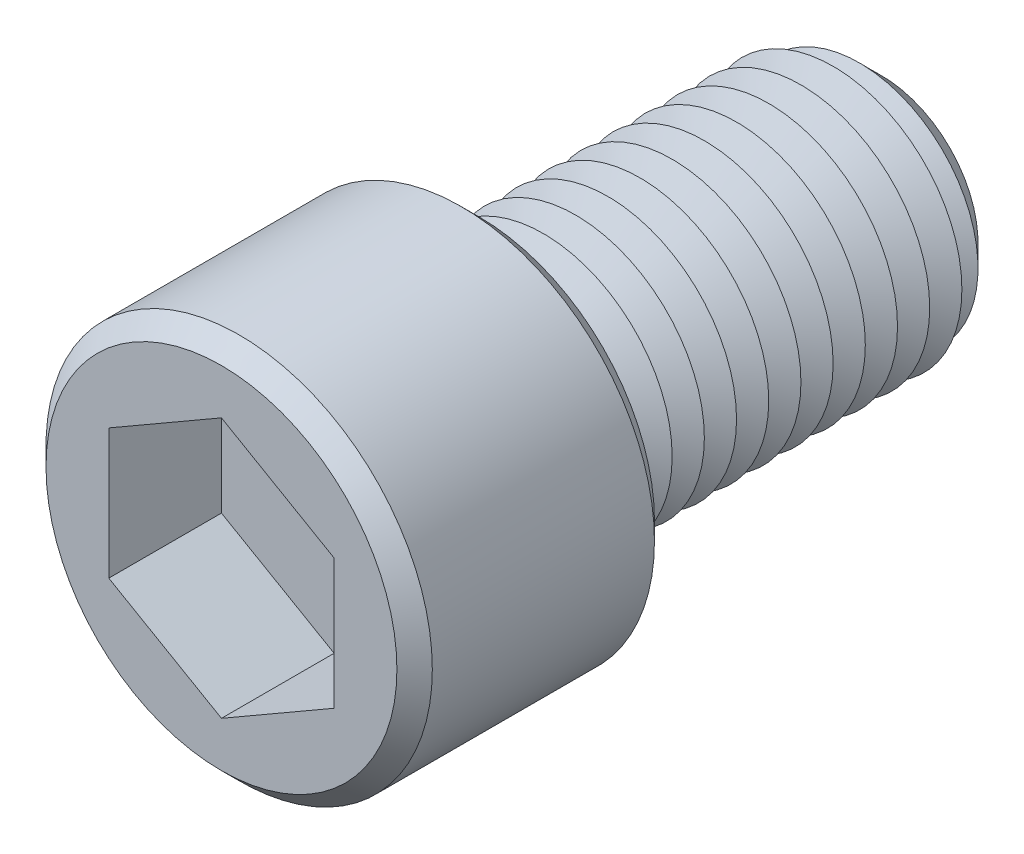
ISO-10303-21;
HEADER;
FILE_DESCRIPTION(('STEP AP214'),'2;1');
FILE_NAME('part.step','',(''),(''),'','','');
FILE_SCHEMA(('AUTOMOTIVE_DESIGN { 1 0 10303 214 1 1 1 1 }'));
ENDSEC;
DATA;
#1=APPLICATION_CONTEXT('core data for automotive mechanical design processes');
#2=APPLICATION_PROTOCOL_DEFINITION('international standard','automotive_design',2000,#1);
#3=PRODUCT_CONTEXT('',#1,'mechanical');
#4=PRODUCT('Part','Part','',(#3));
#5=PRODUCT_RELATED_PRODUCT_CATEGORY('part','',(#4));
#6=PRODUCT_DEFINITION_FORMATION('','',#4);
#7=PRODUCT_DEFINITION_CONTEXT('part definition',#1,'design');
#8=PRODUCT_DEFINITION('design','',#6,#7);
#9=PRODUCT_DEFINITION_SHAPE('','',#8);
#10=(LENGTH_UNIT() NAMED_UNIT(*) SI_UNIT(.MILLI.,.METRE.));
#11=(NAMED_UNIT(*) PLANE_ANGLE_UNIT() SI_UNIT($,.RADIAN.));
#12=(NAMED_UNIT(*) SI_UNIT($,.STERADIAN.) SOLID_ANGLE_UNIT());
#13=UNCERTAINTY_MEASURE_WITH_UNIT(LENGTH_MEASURE(1.E-05),#10,'distance_accuracy_value','');
#14=(GEOMETRIC_REPRESENTATION_CONTEXT(3) GLOBAL_UNCERTAINTY_ASSIGNED_CONTEXT((#13)) GLOBAL_UNIT_ASSIGNED_CONTEXT((#10,
#11,#12)) REPRESENTATION_CONTEXT('',''));
#15=CARTESIAN_POINT('',(0.,0.,0.));
#16=DIRECTION('',(0.,0.,1.));
#17=DIRECTION('',(1.,0.,0.));
#18=AXIS2_PLACEMENT_3D('',#15,#16,#17);
#19=CARTESIAN_POINT('',(0.,0.,16.));
#20=DIRECTION('',(0.,0.,-1.));
#21=DIRECTION('',(-1.,0.,0.));
#22=AXIS2_PLACEMENT_3D('',#19,#20,#21);
#23=CYLINDRICAL_SURFACE('',#22,12.);
#24=CARTESIAN_POINT('',(0.,0.,1.1));
#25=DIRECTION('',(0.,0.,1.));
#26=DIRECTION('',(1.,0.,0.));
#27=AXIS2_PLACEMENT_3D('',#24,#25,#26);
#28=CIRCLE('',#27,12.);
#29=CARTESIAN_POINT('',(12.,0.,1.1));
#30=VERTEX_POINT('',#29);
#31=EDGE_CURVE('E272',#30,#30,#28,.T.);
#32=ORIENTED_EDGE('',*,*,#31,.T.);
#33=EDGE_LOOP('',(#32));
#34=FACE_BOUND('',#33,.T.);
#35=CARTESIAN_POINT('',(0.,0.,14.9));
#36=DIRECTION('',(0.,0.,1.));
#37=DIRECTION('',(1.,0.,0.));
#38=AXIS2_PLACEMENT_3D('',#35,#36,#37);
#39=CIRCLE('',#38,12.);
#40=CARTESIAN_POINT('',(12.,0.,14.9));
#41=VERTEX_POINT('',#40);
#42=EDGE_CURVE('E265',#41,#41,#39,.F.);
#43=ORIENTED_EDGE('',*,*,#42,.T.);
#44=EDGE_LOOP('',(#43));
#45=FACE_BOUND('',#44,.T.);
#46=ADVANCED_FACE('F39',(#34,#45),#23,.T.);
#47=CARTESIAN_POINT('',(0.,0.,16.));
#48=DIRECTION('',(0.,0.,1.));
#49=DIRECTION('',(1.,0.,0.));
#50=AXIS2_PLACEMENT_3D('',#47,#48,#49);
#51=PLANE('',#50);
#52=CARTESIAN_POINT('',(0.,0.,16.));
#53=DIRECTION('',(0.,0.,1.));
#54=DIRECTION('',(1.,0.,0.));
#55=AXIS2_PLACEMENT_3D('',#52,#53,#54);
#56=CIRCLE('',#55,10.9);
#57=CARTESIAN_POINT('',(10.9,0.,16.));
#58=VERTEX_POINT('',#57);
#59=EDGE_CURVE('E11',#58,#58,#56,.T.);
#60=ORIENTED_EDGE('',*,*,#59,.T.);
#61=EDGE_LOOP('',(#60));
#62=FACE_BOUND('',#61,.T.);
#63=DIRECTION('',(-0.866025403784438,0.5,0.));
#64=VECTOR('',#63,1.);
#65=CARTESIAN_POINT('',(7.,4.04145188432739,16.));
#66=LINE('',#65,#64);
#67=CARTESIAN_POINT('',(7.,4.04145188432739,16.));
#68=VERTEX_POINT('',#67);
#69=CARTESIAN_POINT('',(0.,8.08290376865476,16.));
#70=VERTEX_POINT('',#69);
#71=EDGE_CURVE('E55',#68,#70,#66,.T.);
#72=ORIENTED_EDGE('',*,*,#71,.F.);
#73=DIRECTION('',(0.,1.,0.));
#74=VECTOR('',#73,1.);
#75=CARTESIAN_POINT('',(7.,-4.04145188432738,16.));
#76=LINE('',#75,#74);
#77=CARTESIAN_POINT('',(7.,-4.04145188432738,16.));
#78=VERTEX_POINT('',#77);
#79=EDGE_CURVE('E151',#78,#68,#76,.T.);
#80=ORIENTED_EDGE('',*,*,#79,.F.);
#81=DIRECTION('',(0.866025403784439,0.5,0.));
#82=VECTOR('',#81,1.);
#83=CARTESIAN_POINT('',(0.,-8.08290376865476,16.));
#84=LINE('',#83,#82);
#85=CARTESIAN_POINT('',(0.,-8.08290376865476,16.));
#86=VERTEX_POINT('',#85);
#87=EDGE_CURVE('E148',#86,#78,#84,.T.);
#88=ORIENTED_EDGE('',*,*,#87,.F.);
#89=DIRECTION('',(0.866025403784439,-0.5,0.));
#90=VECTOR('',#89,1.);
#91=CARTESIAN_POINT('',(-7.,-4.04145188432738,16.));
#92=LINE('',#91,#90);
#93=CARTESIAN_POINT('',(-7.,-4.04145188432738,16.));
#94=VERTEX_POINT('',#93);
#95=EDGE_CURVE('E103',#94,#86,#92,.T.);
#96=ORIENTED_EDGE('',*,*,#95,.F.);
#97=DIRECTION('',(0.,-1.,0.));
#98=VECTOR('',#97,1.);
#99=CARTESIAN_POINT('',(-7.,4.04145188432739,16.));
#100=LINE('',#99,#98);
#101=CARTESIAN_POINT('',(-7.,4.04145188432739,16.));
#102=VERTEX_POINT('',#101);
#103=EDGE_CURVE('E142',#102,#94,#100,.T.);
#104=ORIENTED_EDGE('',*,*,#103,.F.);
#105=DIRECTION('',(-0.866025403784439,-0.5,0.));
#106=VECTOR('',#105,1.);
#107=CARTESIAN_POINT('',(0.,8.08290376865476,16.));
#108=LINE('',#107,#106);
#109=EDGE_CURVE('E137',#70,#102,#108,.T.);
#110=ORIENTED_EDGE('',*,*,#109,.F.);
#111=EDGE_LOOP('',(#72,#80,#88,#96,#104,#110));
#112=FACE_BOUND('',#111,.T.);
#113=ADVANCED_FACE('F291',(#62,#112),#51,.T.);
#114=CARTESIAN_POINT('',(0.,0.,0.));
#115=DIRECTION('',(0.,0.,1.));
#116=DIRECTION('',(1.,0.,0.));
#117=AXIS2_PLACEMENT_3D('',#114,#115,#116);
#118=PLANE('',#117);
#119=CARTESIAN_POINT('',(0.,0.,0.));
#120=DIRECTION('',(0.,0.,1.));
#121=DIRECTION('',(1.,0.,0.));
#122=AXIS2_PLACEMENT_3D('',#119,#120,#121);
#123=CIRCLE('',#122,10.9);
#124=CARTESIAN_POINT('',(10.9,0.,0.));
#125=VERTEX_POINT('',#124);
#126=EDGE_CURVE('E48',#125,#125,#123,.F.);
#127=ORIENTED_EDGE('',*,*,#126,.T.);
#128=EDGE_LOOP('',(#127));
#129=FACE_BOUND('',#128,.T.);
#130=CARTESIAN_POINT('',(0.,0.,0.));
#131=DIRECTION('',(0.,0.,1.));
#132=DIRECTION('',(1.,0.,0.));
#133=AXIS2_PLACEMENT_3D('',#130,#131,#132);
#134=CIRCLE('',#133,8.);
#135=CARTESIAN_POINT('',(8.,0.,0.));
#136=VERTEX_POINT('',#135);
#137=EDGE_CURVE('E257',#136,#136,#134,.T.);
#138=ORIENTED_EDGE('',*,*,#137,.T.);
#139=EDGE_LOOP('',(#138));
#140=FACE_BOUND('',#139,.T.);
#141=ADVANCED_FACE('F280',(#129,#140),#118,.F.);
#142=CARTESIAN_POINT('',(0.,0.,0.));
#143=DIRECTION('',(0.,0.,1.));
#144=DIRECTION('',(1.,0.,0.));
#145=AXIS2_PLACEMENT_3D('',#142,#143,#144);
#146=CONICAL_SURFACE('',#145,8.,1.0471975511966);
#147=CARTESIAN_POINT('',(0.,0.,-0.999999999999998));
#148=DIRECTION('',(0.,0.,1.));
#149=DIRECTION('',(1.,0.,0.));
#150=AXIS2_PLACEMENT_3D('',#147,#148,#149);
#151=CIRCLE('',#150,6.26794919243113);
#152=CARTESIAN_POINT('',(6.26794919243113,0.,-0.999999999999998));
#153=VERTEX_POINT('',#152);
#154=EDGE_CURVE('E253',#153,#153,#151,.T.);
#155=ORIENTED_EDGE('',*,*,#154,.T.);
#156=EDGE_LOOP('',(#155));
#157=FACE_BOUND('',#156,.T.);
#158=ORIENTED_EDGE('',*,*,#137,.F.);
#159=EDGE_LOOP('',(#158));
#160=FACE_BOUND('',#159,.T.);
#161=ADVANCED_FACE('F436',(#157,#160),#146,.T.);
#162=CARTESIAN_POINT('',(0.,0.,-0.999999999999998));
#163=DIRECTION('',(0.,0.,-1.));
#164=DIRECTION('',(-1.,0.,0.));
#165=AXIS2_PLACEMENT_3D('',#162,#163,#164);
#166=CONICAL_SURFACE('',#165,6.26794919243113,1.0471975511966);
#167=CARTESIAN_POINT('',(0.,0.,-2.));
#168=DIRECTION('',(0.,0.,1.));
#169=DIRECTION('',(1.,0.,0.));
#170=AXIS2_PLACEMENT_3D('',#167,#168,#169);
#171=CIRCLE('',#170,8.);
#172=CARTESIAN_POINT('',(8.,0.,-2.));
#173=VERTEX_POINT('',#172);
#174=EDGE_CURVE('E249',#173,#173,#171,.T.);
#175=ORIENTED_EDGE('',*,*,#174,.T.);
#176=EDGE_LOOP('',(#175));
#177=FACE_BOUND('',#176,.T.);
#178=ORIENTED_EDGE('',*,*,#154,.F.);
#179=EDGE_LOOP('',(#178));
#180=FACE_BOUND('',#179,.T.);
#181=ADVANCED_FACE('F432',(#177,#180),#166,.T.);
#182=CARTESIAN_POINT('',(0.,0.,-2.));
#183=DIRECTION('',(0.,0.,1.));
#184=DIRECTION('',(1.,0.,0.));
#185=AXIS2_PLACEMENT_3D('',#182,#183,#184);
#186=CONICAL_SURFACE('',#185,8.,1.0471975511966);
#187=CARTESIAN_POINT('',(0.,0.,-3.));
#188=DIRECTION('',(0.,0.,1.));
#189=DIRECTION('',(1.,0.,0.));
#190=AXIS2_PLACEMENT_3D('',#187,#188,#189);
#191=CIRCLE('',#190,6.26794919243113);
#192=CARTESIAN_POINT('',(6.26794919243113,0.,-3.));
#193=VERTEX_POINT('',#192);
#194=EDGE_CURVE('E245',#193,#193,#191,.T.);
#195=ORIENTED_EDGE('',*,*,#194,.T.);
#196=EDGE_LOOP('',(#195));
#197=FACE_BOUND('',#196,.T.);
#198=ORIENTED_EDGE('',*,*,#174,.F.);
#199=EDGE_LOOP('',(#198));
#200=FACE_BOUND('',#199,.T.);
#201=ADVANCED_FACE('F428',(#197,#200),#186,.T.);
#202=CARTESIAN_POINT('',(0.,0.,-3.));
#203=DIRECTION('',(0.,0.,-1.));
#204=DIRECTION('',(-1.,0.,0.));
#205=AXIS2_PLACEMENT_3D('',#202,#203,#204);
#206=CONICAL_SURFACE('',#205,6.26794919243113,1.0471975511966);
#207=CARTESIAN_POINT('',(0.,0.,-4.));
#208=DIRECTION('',(0.,0.,1.));
#209=DIRECTION('',(1.,0.,0.));
#210=AXIS2_PLACEMENT_3D('',#207,#208,#209);
#211=CIRCLE('',#210,8.);
#212=CARTESIAN_POINT('',(8.,0.,-4.));
#213=VERTEX_POINT('',#212);
#214=EDGE_CURVE('E241',#213,#213,#211,.T.);
#215=ORIENTED_EDGE('',*,*,#214,.T.);
#216=EDGE_LOOP('',(#215));
#217=FACE_BOUND('',#216,.T.);
#218=ORIENTED_EDGE('',*,*,#194,.F.);
#219=EDGE_LOOP('',(#218));
#220=FACE_BOUND('',#219,.T.);
#221=ADVANCED_FACE('F424',(#217,#220),#206,.T.);
#222=CARTESIAN_POINT('',(0.,0.,-4.));
#223=DIRECTION('',(0.,0.,1.));
#224=DIRECTION('',(1.,0.,0.));
#225=AXIS2_PLACEMENT_3D('',#222,#223,#224);
#226=CONICAL_SURFACE('',#225,8.,1.0471975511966);
#227=CARTESIAN_POINT('',(0.,0.,-5.));
#228=DIRECTION('',(0.,0.,1.));
#229=DIRECTION('',(1.,0.,0.));
#230=AXIS2_PLACEMENT_3D('',#227,#228,#229);
#231=CIRCLE('',#230,6.26794919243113);
#232=CARTESIAN_POINT('',(6.26794919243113,0.,-5.));
#233=VERTEX_POINT('',#232);
#234=EDGE_CURVE('E237',#233,#233,#231,.T.);
#235=ORIENTED_EDGE('',*,*,#234,.T.);
#236=EDGE_LOOP('',(#235));
#237=FACE_BOUND('',#236,.T.);
#238=ORIENTED_EDGE('',*,*,#214,.F.);
#239=EDGE_LOOP('',(#238));
#240=FACE_BOUND('',#239,.T.);
#241=ADVANCED_FACE('F420',(#237,#240),#226,.T.);
#242=CARTESIAN_POINT('',(0.,0.,-5.));
#243=DIRECTION('',(0.,0.,-1.));
#244=DIRECTION('',(-1.,0.,0.));
#245=AXIS2_PLACEMENT_3D('',#242,#243,#244);
#246=CONICAL_SURFACE('',#245,6.26794919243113,1.0471975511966);
#247=CARTESIAN_POINT('',(0.,0.,-6.));
#248=DIRECTION('',(0.,0.,1.));
#249=DIRECTION('',(1.,0.,0.));
#250=AXIS2_PLACEMENT_3D('',#247,#248,#249);
#251=CIRCLE('',#250,8.);
#252=CARTESIAN_POINT('',(8.,0.,-6.));
#253=VERTEX_POINT('',#252);
#254=EDGE_CURVE('E233',#253,#253,#251,.T.);
#255=ORIENTED_EDGE('',*,*,#254,.T.);
#256=EDGE_LOOP('',(#255));
#257=FACE_BOUND('',#256,.T.);
#258=ORIENTED_EDGE('',*,*,#234,.F.);
#259=EDGE_LOOP('',(#258));
#260=FACE_BOUND('',#259,.T.);
#261=ADVANCED_FACE('F416',(#257,#260),#246,.T.);
#262=CARTESIAN_POINT('',(0.,0.,-6.));
#263=DIRECTION('',(0.,0.,1.));
#264=DIRECTION('',(1.,0.,0.));
#265=AXIS2_PLACEMENT_3D('',#262,#263,#264);
#266=CONICAL_SURFACE('',#265,8.,1.0471975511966);
#267=CARTESIAN_POINT('',(0.,0.,-7.));
#268=DIRECTION('',(0.,0.,1.));
#269=DIRECTION('',(1.,0.,0.));
#270=AXIS2_PLACEMENT_3D('',#267,#268,#269);
#271=CIRCLE('',#270,6.26794919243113);
#272=CARTESIAN_POINT('',(6.26794919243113,0.,-7.));
#273=VERTEX_POINT('',#272);
#274=EDGE_CURVE('E229',#273,#273,#271,.T.);
#275=ORIENTED_EDGE('',*,*,#274,.T.);
#276=EDGE_LOOP('',(#275));
#277=FACE_BOUND('',#276,.T.);
#278=ORIENTED_EDGE('',*,*,#254,.F.);
#279=EDGE_LOOP('',(#278));
#280=FACE_BOUND('',#279,.T.);
#281=ADVANCED_FACE('F412',(#277,#280),#266,.T.);
#282=CARTESIAN_POINT('',(0.,0.,-7.));
#283=DIRECTION('',(0.,0.,-1.));
#284=DIRECTION('',(-1.,0.,0.));
#285=AXIS2_PLACEMENT_3D('',#282,#283,#284);
#286=CONICAL_SURFACE('',#285,6.26794919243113,1.0471975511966);
#287=CARTESIAN_POINT('',(0.,0.,-8.));
#288=DIRECTION('',(0.,0.,1.));
#289=DIRECTION('',(1.,0.,0.));
#290=AXIS2_PLACEMENT_3D('',#287,#288,#289);
#291=CIRCLE('',#290,8.);
#292=CARTESIAN_POINT('',(8.,0.,-8.));
#293=VERTEX_POINT('',#292);
#294=EDGE_CURVE('E225',#293,#293,#291,.T.);
#295=ORIENTED_EDGE('',*,*,#294,.T.);
#296=EDGE_LOOP('',(#295));
#297=FACE_BOUND('',#296,.T.);
#298=ORIENTED_EDGE('',*,*,#274,.F.);
#299=EDGE_LOOP('',(#298));
#300=FACE_BOUND('',#299,.T.);
#301=ADVANCED_FACE('F408',(#297,#300),#286,.T.);
#302=CARTESIAN_POINT('',(0.,0.,-8.));
#303=DIRECTION('',(0.,0.,1.));
#304=DIRECTION('',(1.,0.,0.));
#305=AXIS2_PLACEMENT_3D('',#302,#303,#304);
#306=CONICAL_SURFACE('',#305,8.,1.0471975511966);
#307=CARTESIAN_POINT('',(0.,0.,-9.));
#308=DIRECTION('',(0.,0.,1.));
#309=DIRECTION('',(1.,0.,0.));
#310=AXIS2_PLACEMENT_3D('',#307,#308,#309);
#311=CIRCLE('',#310,6.26794919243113);
#312=CARTESIAN_POINT('',(6.26794919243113,0.,-9.));
#313=VERTEX_POINT('',#312);
#314=EDGE_CURVE('E221',#313,#313,#311,.T.);
#315=ORIENTED_EDGE('',*,*,#314,.T.);
#316=EDGE_LOOP('',(#315));
#317=FACE_BOUND('',#316,.T.);
#318=ORIENTED_EDGE('',*,*,#294,.F.);
#319=EDGE_LOOP('',(#318));
#320=FACE_BOUND('',#319,.T.);
#321=ADVANCED_FACE('F404',(#317,#320),#306,.T.);
#322=CARTESIAN_POINT('',(0.,0.,-9.));
#323=DIRECTION('',(0.,0.,-1.));
#324=DIRECTION('',(-1.,0.,0.));
#325=AXIS2_PLACEMENT_3D('',#322,#323,#324);
#326=CONICAL_SURFACE('',#325,6.26794919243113,1.0471975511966);
#327=CARTESIAN_POINT('',(0.,0.,-10.));
#328=DIRECTION('',(0.,0.,1.));
#329=DIRECTION('',(1.,0.,0.));
#330=AXIS2_PLACEMENT_3D('',#327,#328,#329);
#331=CIRCLE('',#330,8.);
#332=CARTESIAN_POINT('',(8.,0.,-10.));
#333=VERTEX_POINT('',#332);
#334=EDGE_CURVE('E217',#333,#333,#331,.T.);
#335=ORIENTED_EDGE('',*,*,#334,.T.);
#336=EDGE_LOOP('',(#335));
#337=FACE_BOUND('',#336,.T.);
#338=ORIENTED_EDGE('',*,*,#314,.F.);
#339=EDGE_LOOP('',(#338));
#340=FACE_BOUND('',#339,.T.);
#341=ADVANCED_FACE('F400',(#337,#340),#326,.T.);
#342=CARTESIAN_POINT('',(0.,0.,-10.));
#343=DIRECTION('',(0.,0.,1.));
#344=DIRECTION('',(1.,0.,0.));
#345=AXIS2_PLACEMENT_3D('',#342,#343,#344);
#346=CONICAL_SURFACE('',#345,8.,1.0471975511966);
#347=CARTESIAN_POINT('',(0.,0.,-11.));
#348=DIRECTION('',(0.,0.,1.));
#349=DIRECTION('',(1.,0.,0.));
#350=AXIS2_PLACEMENT_3D('',#347,#348,#349);
#351=CIRCLE('',#350,6.26794919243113);
#352=CARTESIAN_POINT('',(6.26794919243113,0.,-11.));
#353=VERTEX_POINT('',#352);
#354=EDGE_CURVE('E214',#353,#353,#351,.T.);
#355=ORIENTED_EDGE('',*,*,#354,.T.);
#356=EDGE_LOOP('',(#355));
#357=FACE_BOUND('',#356,.T.);
#358=ORIENTED_EDGE('',*,*,#334,.F.);
#359=EDGE_LOOP('',(#358));
#360=FACE_BOUND('',#359,.T.);
#361=ADVANCED_FACE('F396',(#357,#360),#346,.T.);
#362=CARTESIAN_POINT('',(0.,0.,-11.));
#363=DIRECTION('',(0.,0.,-1.));
#364=DIRECTION('',(-1.,0.,0.));
#365=AXIS2_PLACEMENT_3D('',#362,#363,#364);
#366=CONICAL_SURFACE('',#365,6.26794919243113,1.0471975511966);
#367=CARTESIAN_POINT('',(0.,0.,-12.));
#368=DIRECTION('',(0.,0.,1.));
#369=DIRECTION('',(1.,0.,0.));
#370=AXIS2_PLACEMENT_3D('',#367,#368,#369);
#371=CIRCLE('',#370,8.);
#372=CARTESIAN_POINT('',(8.,0.,-12.));
#373=VERTEX_POINT('',#372);
#374=EDGE_CURVE('E210',#373,#373,#371,.T.);
#375=ORIENTED_EDGE('',*,*,#374,.T.);
#376=EDGE_LOOP('',(#375));
#377=FACE_BOUND('',#376,.T.);
#378=ORIENTED_EDGE('',*,*,#354,.F.);
#379=EDGE_LOOP('',(#378));
#380=FACE_BOUND('',#379,.T.);
#381=ADVANCED_FACE('F392',(#377,#380),#366,.T.);
#382=CARTESIAN_POINT('',(0.,0.,-12.));
#383=DIRECTION('',(0.,0.,1.));
#384=DIRECTION('',(1.,0.,0.));
#385=AXIS2_PLACEMENT_3D('',#382,#383,#384);
#386=CONICAL_SURFACE('',#385,8.,1.0471975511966);
#387=CARTESIAN_POINT('',(0.,0.,-13.));
#388=DIRECTION('',(0.,0.,1.));
#389=DIRECTION('',(1.,0.,0.));
#390=AXIS2_PLACEMENT_3D('',#387,#388,#389);
#391=CIRCLE('',#390,6.26794919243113);
#392=CARTESIAN_POINT('',(6.26794919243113,0.,-13.));
#393=VERTEX_POINT('',#392);
#394=EDGE_CURVE('E206',#393,#393,#391,.T.);
#395=ORIENTED_EDGE('',*,*,#394,.T.);
#396=EDGE_LOOP('',(#395));
#397=FACE_BOUND('',#396,.T.);
#398=ORIENTED_EDGE('',*,*,#374,.F.);
#399=EDGE_LOOP('',(#398));
#400=FACE_BOUND('',#399,.T.);
#401=ADVANCED_FACE('F388',(#397,#400),#386,.T.);
#402=CARTESIAN_POINT('',(0.,0.,-13.));
#403=DIRECTION('',(0.,0.,-1.));
#404=DIRECTION('',(-1.,0.,0.));
#405=AXIS2_PLACEMENT_3D('',#402,#403,#404);
#406=CONICAL_SURFACE('',#405,6.26794919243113,1.0471975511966);
#407=CARTESIAN_POINT('',(0.,0.,-14.));
#408=DIRECTION('',(0.,0.,1.));
#409=DIRECTION('',(1.,0.,0.));
#410=AXIS2_PLACEMENT_3D('',#407,#408,#409);
#411=CIRCLE('',#410,8.);
#412=CARTESIAN_POINT('',(8.,0.,-14.));
#413=VERTEX_POINT('',#412);
#414=EDGE_CURVE('E203',#413,#413,#411,.T.);
#415=ORIENTED_EDGE('',*,*,#414,.T.);
#416=EDGE_LOOP('',(#415));
#417=FACE_BOUND('',#416,.T.);
#418=ORIENTED_EDGE('',*,*,#394,.F.);
#419=EDGE_LOOP('',(#418));
#420=FACE_BOUND('',#419,.T.);
#421=ADVANCED_FACE('F384',(#417,#420),#406,.T.);
#422=CARTESIAN_POINT('',(0.,0.,-14.));
#423=DIRECTION('',(0.,0.,1.));
#424=DIRECTION('',(1.,0.,0.));
#425=AXIS2_PLACEMENT_3D('',#422,#423,#424);
#426=CONICAL_SURFACE('',#425,8.,1.0471975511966);
#427=CARTESIAN_POINT('',(0.,0.,-15.));
#428=DIRECTION('',(0.,0.,1.));
#429=DIRECTION('',(1.,0.,0.));
#430=AXIS2_PLACEMENT_3D('',#427,#428,#429);
#431=CIRCLE('',#430,6.26794919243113);
#432=CARTESIAN_POINT('',(6.26794919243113,0.,-15.));
#433=VERTEX_POINT('',#432);
#434=EDGE_CURVE('E199',#433,#433,#431,.T.);
#435=ORIENTED_EDGE('',*,*,#434,.T.);
#436=EDGE_LOOP('',(#435));
#437=FACE_BOUND('',#436,.T.);
#438=ORIENTED_EDGE('',*,*,#414,.F.);
#439=EDGE_LOOP('',(#438));
#440=FACE_BOUND('',#439,.T.);
#441=ADVANCED_FACE('F380',(#437,#440),#426,.T.);
#442=CARTESIAN_POINT('',(0.,0.,-15.));
#443=DIRECTION('',(0.,0.,-1.));
#444=DIRECTION('',(-1.,0.,0.));
#445=AXIS2_PLACEMENT_3D('',#442,#443,#444);
#446=CONICAL_SURFACE('',#445,6.26794919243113,1.0471975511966);
#447=CARTESIAN_POINT('',(0.,0.,-16.));
#448=DIRECTION('',(0.,0.,1.));
#449=DIRECTION('',(1.,0.,0.));
#450=AXIS2_PLACEMENT_3D('',#447,#448,#449);
#451=CIRCLE('',#450,8.);
#452=CARTESIAN_POINT('',(8.,0.,-16.));
#453=VERTEX_POINT('',#452);
#454=EDGE_CURVE('E195',#453,#453,#451,.T.);
#455=ORIENTED_EDGE('',*,*,#454,.T.);
#456=EDGE_LOOP('',(#455));
#457=FACE_BOUND('',#456,.T.);
#458=ORIENTED_EDGE('',*,*,#434,.F.);
#459=EDGE_LOOP('',(#458));
#460=FACE_BOUND('',#459,.T.);
#461=ADVANCED_FACE('F376',(#457,#460),#446,.T.);
#462=CARTESIAN_POINT('',(0.,0.,-16.));
#463=DIRECTION('',(0.,0.,1.));
#464=DIRECTION('',(1.,0.,0.));
#465=AXIS2_PLACEMENT_3D('',#462,#463,#464);
#466=CONICAL_SURFACE('',#465,8.,1.0471975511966);
#467=CARTESIAN_POINT('',(0.,0.,-17.));
#468=DIRECTION('',(0.,0.,1.));
#469=DIRECTION('',(1.,0.,0.));
#470=AXIS2_PLACEMENT_3D('',#467,#468,#469);
#471=CIRCLE('',#470,6.26794919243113);
#472=CARTESIAN_POINT('',(6.26794919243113,0.,-17.));
#473=VERTEX_POINT('',#472);
#474=EDGE_CURVE('E191',#473,#473,#471,.T.);
#475=ORIENTED_EDGE('',*,*,#474,.T.);
#476=EDGE_LOOP('',(#475));
#477=FACE_BOUND('',#476,.T.);
#478=ORIENTED_EDGE('',*,*,#454,.F.);
#479=EDGE_LOOP('',(#478));
#480=FACE_BOUND('',#479,.T.);
#481=ADVANCED_FACE('F372',(#477,#480),#466,.T.);
#482=CARTESIAN_POINT('',(0.,0.,-17.));
#483=DIRECTION('',(0.,0.,-1.));
#484=DIRECTION('',(-1.,0.,0.));
#485=AXIS2_PLACEMENT_3D('',#482,#483,#484);
#486=CONICAL_SURFACE('',#485,6.26794919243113,1.0471975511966);
#487=CARTESIAN_POINT('',(0.,0.,-18.));
#488=DIRECTION('',(0.,0.,1.));
#489=DIRECTION('',(1.,0.,0.));
#490=AXIS2_PLACEMENT_3D('',#487,#488,#489);
#491=CIRCLE('',#490,8.);
#492=CARTESIAN_POINT('',(8.,0.,-18.));
#493=VERTEX_POINT('',#492);
#494=EDGE_CURVE('E187',#493,#493,#491,.T.);
#495=ORIENTED_EDGE('',*,*,#494,.T.);
#496=EDGE_LOOP('',(#495));
#497=FACE_BOUND('',#496,.T.);
#498=ORIENTED_EDGE('',*,*,#474,.F.);
#499=EDGE_LOOP('',(#498));
#500=FACE_BOUND('',#499,.T.);
#501=ADVANCED_FACE('F368',(#497,#500),#486,.T.);
#502=CARTESIAN_POINT('',(0.,0.,-18.));
#503=DIRECTION('',(0.,0.,1.));
#504=DIRECTION('',(1.,0.,0.));
#505=AXIS2_PLACEMENT_3D('',#502,#503,#504);
#506=CONICAL_SURFACE('',#505,8.,1.0471975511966);
#507=CARTESIAN_POINT('',(0.,0.,-19.));
#508=DIRECTION('',(0.,0.,1.));
#509=DIRECTION('',(1.,0.,0.));
#510=AXIS2_PLACEMENT_3D('',#507,#508,#509);
#511=CIRCLE('',#510,6.26794919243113);
#512=CARTESIAN_POINT('',(6.26794919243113,0.,-19.));
#513=VERTEX_POINT('',#512);
#514=EDGE_CURVE('E183',#513,#513,#511,.T.);
#515=ORIENTED_EDGE('',*,*,#514,.T.);
#516=EDGE_LOOP('',(#515));
#517=FACE_BOUND('',#516,.T.);
#518=ORIENTED_EDGE('',*,*,#494,.F.);
#519=EDGE_LOOP('',(#518));
#520=FACE_BOUND('',#519,.T.);
#521=ADVANCED_FACE('F364',(#517,#520),#506,.T.);
#522=CARTESIAN_POINT('',(0.,0.,-19.));
#523=DIRECTION('',(0.,0.,-1.));
#524=DIRECTION('',(-1.,0.,0.));
#525=AXIS2_PLACEMENT_3D('',#522,#523,#524);
#526=CONICAL_SURFACE('',#525,6.26794919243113,1.0471975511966);
#527=CARTESIAN_POINT('',(0.,0.,-20.));
#528=DIRECTION('',(0.,0.,1.));
#529=DIRECTION('',(1.,0.,0.));
#530=AXIS2_PLACEMENT_3D('',#527,#528,#529);
#531=CIRCLE('',#530,8.);
#532=CARTESIAN_POINT('',(8.,0.,-20.));
#533=VERTEX_POINT('',#532);
#534=EDGE_CURVE('E179',#533,#533,#531,.T.);
#535=ORIENTED_EDGE('',*,*,#534,.T.);
#536=EDGE_LOOP('',(#535));
#537=FACE_BOUND('',#536,.T.);
#538=ORIENTED_EDGE('',*,*,#514,.F.);
#539=EDGE_LOOP('',(#538));
#540=FACE_BOUND('',#539,.T.);
#541=ADVANCED_FACE('F360',(#537,#540),#526,.T.);
#542=CARTESIAN_POINT('',(0.,0.,-20.));
#543=DIRECTION('',(0.,0.,1.));
#544=DIRECTION('',(1.,0.,0.));
#545=AXIS2_PLACEMENT_3D('',#542,#543,#544);
#546=CONICAL_SURFACE('',#545,8.,1.0471975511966);
#547=CARTESIAN_POINT('',(0.,0.,-21.));
#548=DIRECTION('',(0.,0.,1.));
#549=DIRECTION('',(1.,0.,0.));
#550=AXIS2_PLACEMENT_3D('',#547,#548,#549);
#551=CIRCLE('',#550,6.26794919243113);
#552=CARTESIAN_POINT('',(6.26794919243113,0.,-21.));
#553=VERTEX_POINT('',#552);
#554=EDGE_CURVE('E175',#553,#553,#551,.T.);
#555=ORIENTED_EDGE('',*,*,#554,.T.);
#556=EDGE_LOOP('',(#555));
#557=FACE_BOUND('',#556,.T.);
#558=ORIENTED_EDGE('',*,*,#534,.F.);
#559=EDGE_LOOP('',(#558));
#560=FACE_BOUND('',#559,.T.);
#561=ADVANCED_FACE('F356',(#557,#560),#546,.T.);
#562=CARTESIAN_POINT('',(0.,0.,-21.));
#563=DIRECTION('',(0.,0.,-1.));
#564=DIRECTION('',(-1.,0.,0.));
#565=AXIS2_PLACEMENT_3D('',#562,#563,#564);
#566=CONICAL_SURFACE('',#565,6.26794919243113,1.0471975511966);
#567=CARTESIAN_POINT('',(0.,0.,-22.));
#568=DIRECTION('',(0.,0.,1.));
#569=DIRECTION('',(1.,0.,0.));
#570=AXIS2_PLACEMENT_3D('',#567,#568,#569);
#571=CIRCLE('',#570,8.);
#572=CARTESIAN_POINT('',(8.,0.,-22.));
#573=VERTEX_POINT('',#572);
#574=EDGE_CURVE('E170',#573,#573,#571,.T.);
#575=ORIENTED_EDGE('',*,*,#574,.T.);
#576=EDGE_LOOP('',(#575));
#577=FACE_BOUND('',#576,.T.);
#578=ORIENTED_EDGE('',*,*,#554,.F.);
#579=EDGE_LOOP('',(#578));
#580=FACE_BOUND('',#579,.T.);
#581=ADVANCED_FACE('F352',(#577,#580),#566,.T.);
#582=CARTESIAN_POINT('',(0.,0.,-22.));
#583=DIRECTION('',(0.,0.,1.));
#584=DIRECTION('',(1.,0.,0.));
#585=AXIS2_PLACEMENT_3D('',#582,#583,#584);
#586=CONICAL_SURFACE('',#585,8.,1.0471975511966);
#587=CARTESIAN_POINT('',(0.,0.,-23.));
#588=DIRECTION('',(0.,0.,1.));
#589=DIRECTION('',(1.,0.,0.));
#590=AXIS2_PLACEMENT_3D('',#587,#588,#589);
#591=CIRCLE('',#590,6.26794919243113);
#592=CARTESIAN_POINT('',(6.26794919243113,0.,-23.));
#593=VERTEX_POINT('',#592);
#594=EDGE_CURVE('E157',#593,#593,#591,.T.);
#595=ORIENTED_EDGE('',*,*,#594,.T.);
#596=EDGE_LOOP('',(#595));
#597=FACE_BOUND('',#596,.T.);
#598=ORIENTED_EDGE('',*,*,#574,.F.);
#599=EDGE_LOOP('',(#598));
#600=FACE_BOUND('',#599,.T.);
#601=ADVANCED_FACE('F348',(#597,#600),#586,.T.);
#602=CARTESIAN_POINT('',(0.,0.,-23.));
#603=DIRECTION('',(0.,0.,-1.));
#604=DIRECTION('',(-1.,0.,0.));
#605=AXIS2_PLACEMENT_3D('',#602,#603,#604);
#606=CONICAL_SURFACE('',#605,6.26794919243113,1.0471975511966);
#607=CARTESIAN_POINT('',(0.,0.,-23.6339745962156));
#608=DIRECTION('',(0.,0.,-1.));
#609=DIRECTION('',(-1.,0.,0.));
#610=AXIS2_PLACEMENT_3D('',#607,#608,#609);
#611=CIRCLE('',#610,7.36602540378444);
#612=CARTESIAN_POINT('',(-7.36602540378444,0.,-23.6339745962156));
#613=VERTEX_POINT('',#612);
#614=EDGE_CURVE('E174',#613,#613,#611,.T.);
#615=ORIENTED_EDGE('',*,*,#614,.F.);
#616=EDGE_LOOP('',(#615));
#617=FACE_BOUND('',#616,.T.);
#618=ORIENTED_EDGE('',*,*,#594,.F.);
#619=EDGE_LOOP('',(#618));
#620=FACE_BOUND('',#619,.T.);
#621=ADVANCED_FACE('F344',(#617,#620),#606,.T.);
#622=CARTESIAN_POINT('',(0.,0.,-25.));
#623=DIRECTION('',(0.,0.,-1.));
#624=DIRECTION('',(-1.,0.,0.));
#625=AXIS2_PLACEMENT_3D('',#622,#623,#624);
#626=PLANE('',#625);
#627=CARTESIAN_POINT('',(0.,0.,-25.));
#628=DIRECTION('',(0.,0.,-1.));
#629=DIRECTION('',(-1.,0.,0.));
#630=AXIS2_PLACEMENT_3D('',#627,#628,#629);
#631=CIRCLE('',#630,0.9);
#632=CARTESIAN_POINT('',(-0.9,0.,-25.));
#633=VERTEX_POINT('',#632);
#634=EDGE_CURVE('E138',#633,#633,#631,.F.);
#635=ORIENTED_EDGE('',*,*,#634,.T.);
#636=EDGE_LOOP('',(#635));
#637=FACE_BOUND('',#636,.T.);
#638=CARTESIAN_POINT('',(0.,0.,-25.));
#639=DIRECTION('',(0.,0.,-1.));
#640=DIRECTION('',(-1.,0.,0.));
#641=AXIS2_PLACEMENT_3D('',#638,#639,#640);
#642=CIRCLE('',#641,6.);
#643=CARTESIAN_POINT('',(-6.,0.,-25.));
#644=VERTEX_POINT('',#643);
#645=EDGE_CURVE('E261',#644,#644,#642,.T.);
#646=ORIENTED_EDGE('',*,*,#645,.T.);
#647=EDGE_LOOP('',(#646));
#648=FACE_BOUND('',#647,.T.);
#649=ADVANCED_FACE('F347',(#637,#648),#626,.T.);
#650=CARTESIAN_POINT('',(0.,0.,-25.));
#651=DIRECTION('',(0.,0.,1.));
#652=DIRECTION('',(1.,0.,0.));
#653=AXIS2_PLACEMENT_3D('',#650,#651,#652);
#654=CONICAL_SURFACE('',#653,6.,0.785398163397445);
#655=ORIENTED_EDGE('',*,*,#645,.F.);
#656=EDGE_LOOP('',(#655));
#657=FACE_BOUND('',#656,.T.);
#658=ORIENTED_EDGE('',*,*,#614,.T.);
#659=EDGE_LOOP('',(#658));
#660=FACE_BOUND('',#659,.T.);
#661=ADVANCED_FACE('F343',(#657,#660),#654,.T.);
#662=CARTESIAN_POINT('',(7.,4.04145188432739,9.));
#663=DIRECTION('',(0.5,0.866025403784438,0.));
#664=DIRECTION('',(-0.866025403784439,0.5,0.));
#665=AXIS2_PLACEMENT_3D('',#662,#663,#664);
#666=PLANE('',#665);
#667=ORIENTED_EDGE('',*,*,#71,.T.);
#668=DIRECTION('',(0.,0.,1.));
#669=VECTOR('',#668,1.);
#670=CARTESIAN_POINT('',(0.,8.08290376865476,9.));
#671=LINE('',#670,#669);
#672=CARTESIAN_POINT('',(0.,8.08290376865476,9.));
#673=VERTEX_POINT('',#672);
#674=EDGE_CURVE('E85',#673,#70,#671,.T.);
#675=ORIENTED_EDGE('',*,*,#674,.F.);
#676=DIRECTION('',(-0.866025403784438,0.5,0.));
#677=VECTOR('',#676,1.);
#678=CARTESIAN_POINT('',(7.,4.04145188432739,9.));
#679=LINE('',#678,#677);
#680=CARTESIAN_POINT('',(7.,4.04145188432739,9.));
#681=VERTEX_POINT('',#680);
#682=EDGE_CURVE('E154',#681,#673,#679,.T.);
#683=ORIENTED_EDGE('',*,*,#682,.F.);
#684=DIRECTION('',(0.,0.,1.));
#685=VECTOR('',#684,1.);
#686=CARTESIAN_POINT('',(7.,4.04145188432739,9.));
#687=LINE('',#686,#685);
#688=EDGE_CURVE('E63',#681,#68,#687,.T.);
#689=ORIENTED_EDGE('',*,*,#688,.T.);
#690=EDGE_LOOP('',(#667,#675,#683,#689));
#691=FACE_BOUND('',#690,.T.);
#692=ADVANCED_FACE('F333',(#691),#666,.F.);
#693=CARTESIAN_POINT('',(7.,-4.04145188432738,9.));
#694=DIRECTION('',(1.,0.,0.));
#695=DIRECTION('',(0.,1.,0.));
#696=AXIS2_PLACEMENT_3D('',#693,#694,#695);
#697=PLANE('',#696);
#698=ORIENTED_EDGE('',*,*,#79,.T.);
#699=ORIENTED_EDGE('',*,*,#688,.F.);
#700=DIRECTION('',(0.,1.,0.));
#701=VECTOR('',#700,1.);
#702=CARTESIAN_POINT('',(7.,-4.04145188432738,9.));
#703=LINE('',#702,#701);
#704=CARTESIAN_POINT('',(7.,-4.04145188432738,9.));
#705=VERTEX_POINT('',#704);
#706=EDGE_CURVE('E117',#705,#681,#703,.T.);
#707=ORIENTED_EDGE('',*,*,#706,.F.);
#708=DIRECTION('',(0.,0.,1.));
#709=VECTOR('',#708,1.);
#710=CARTESIAN_POINT('',(7.,-4.04145188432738,9.));
#711=LINE('',#710,#709);
#712=EDGE_CURVE('E108',#705,#78,#711,.T.);
#713=ORIENTED_EDGE('',*,*,#712,.T.);
#714=EDGE_LOOP('',(#698,#699,#707,#713));
#715=FACE_BOUND('',#714,.T.);
#716=ADVANCED_FACE('F330',(#715),#697,.F.);
#717=CARTESIAN_POINT('',(0.,-8.08290376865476,9.));
#718=DIRECTION('',(0.5,-0.866025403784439,0.));
#719=DIRECTION('',(0.866025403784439,0.5,0.));
#720=AXIS2_PLACEMENT_3D('',#717,#718,#719);
#721=PLANE('',#720);
#722=ORIENTED_EDGE('',*,*,#87,.T.);
#723=ORIENTED_EDGE('',*,*,#712,.F.);
#724=DIRECTION('',(0.866025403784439,0.5,0.));
#725=VECTOR('',#724,1.);
#726=CARTESIAN_POINT('',(0.,-8.08290376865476,9.));
#727=LINE('',#726,#725);
#728=CARTESIAN_POINT('',(0.,-8.08290376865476,9.));
#729=VERTEX_POINT('',#728);
#730=EDGE_CURVE('E112',#729,#705,#727,.T.);
#731=ORIENTED_EDGE('',*,*,#730,.F.);
#732=DIRECTION('',(0.,0.,1.));
#733=VECTOR('',#732,1.);
#734=CARTESIAN_POINT('',(0.,-8.08290376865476,9.));
#735=LINE('',#734,#733);
#736=EDGE_CURVE('E96',#729,#86,#735,.T.);
#737=ORIENTED_EDGE('',*,*,#736,.T.);
#738=EDGE_LOOP('',(#722,#723,#731,#737));
#739=FACE_BOUND('',#738,.T.);
#740=ADVANCED_FACE('F113',(#739),#721,.F.);
#741=CARTESIAN_POINT('',(-7.,-4.04145188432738,9.));
#742=DIRECTION('',(-0.5,-0.866025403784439,0.));
#743=DIRECTION('',(0.866025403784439,-0.5,0.));
#744=AXIS2_PLACEMENT_3D('',#741,#742,#743);
#745=PLANE('',#744);
#746=ORIENTED_EDGE('',*,*,#95,.T.);
#747=ORIENTED_EDGE('',*,*,#736,.F.);
#748=DIRECTION('',(0.866025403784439,-0.5,0.));
#749=VECTOR('',#748,1.);
#750=CARTESIAN_POINT('',(-7.,-4.04145188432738,9.));
#751=LINE('',#750,#749);
#752=CARTESIAN_POINT('',(-7.,-4.04145188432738,9.));
#753=VERTEX_POINT('',#752);
#754=EDGE_CURVE('E100',#753,#729,#751,.T.);
#755=ORIENTED_EDGE('',*,*,#754,.F.);
#756=DIRECTION('',(0.,0.,1.));
#757=VECTOR('',#756,1.);
#758=CARTESIAN_POINT('',(-7.,-4.04145188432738,9.));
#759=LINE('',#758,#757);
#760=EDGE_CURVE('E109',#753,#94,#759,.T.);
#761=ORIENTED_EDGE('',*,*,#760,.T.);
#762=EDGE_LOOP('',(#746,#747,#755,#761));
#763=FACE_BOUND('',#762,.T.);
#764=ADVANCED_FACE('F98',(#763),#745,.F.);
#765=CARTESIAN_POINT('',(-7.,4.04145188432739,9.));
#766=DIRECTION('',(-1.,0.,0.));
#767=DIRECTION('',(0.,0.,1.));
#768=AXIS2_PLACEMENT_3D('',#765,#766,#767);
#769=PLANE('',#768);
#770=ORIENTED_EDGE('',*,*,#103,.T.);
#771=ORIENTED_EDGE('',*,*,#760,.F.);
#772=DIRECTION('',(0.,-1.,0.));
#773=VECTOR('',#772,1.);
#774=CARTESIAN_POINT('',(-7.,4.04145188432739,9.));
#775=LINE('',#774,#773);
#776=CARTESIAN_POINT('',(-7.,4.04145188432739,9.));
#777=VERTEX_POINT('',#776);
#778=EDGE_CURVE('E123',#777,#753,#775,.T.);
#779=ORIENTED_EDGE('',*,*,#778,.F.);
#780=DIRECTION('',(0.,0.,1.));
#781=VECTOR('',#780,1.);
#782=CARTESIAN_POINT('',(-7.,4.04145188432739,9.));
#783=LINE('',#782,#781);
#784=EDGE_CURVE('E162',#777,#102,#783,.T.);
#785=ORIENTED_EDGE('',*,*,#784,.T.);
#786=EDGE_LOOP('',(#770,#771,#779,#785));
#787=FACE_BOUND('',#786,.T.);
#788=ADVANCED_FACE('F327',(#787),#769,.F.);
#789=CARTESIAN_POINT('',(0.,8.08290376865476,9.));
#790=DIRECTION('',(-0.5,0.866025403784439,0.));
#791=DIRECTION('',(-0.866025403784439,-0.5,0.));
#792=AXIS2_PLACEMENT_3D('',#789,#790,#791);
#793=PLANE('',#792);
#794=ORIENTED_EDGE('',*,*,#109,.T.);
#795=ORIENTED_EDGE('',*,*,#784,.F.);
#796=DIRECTION('',(-0.866025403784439,-0.5,0.));
#797=VECTOR('',#796,1.);
#798=CARTESIAN_POINT('',(0.,8.08290376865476,9.));
#799=LINE('',#798,#797);
#800=EDGE_CURVE('E129',#673,#777,#799,.T.);
#801=ORIENTED_EDGE('',*,*,#800,.F.);
#802=ORIENTED_EDGE('',*,*,#674,.T.);
#803=EDGE_LOOP('',(#794,#795,#801,#802));
#804=FACE_BOUND('',#803,.T.);
#805=ADVANCED_FACE('F306',(#804),#793,.F.);
#806=CARTESIAN_POINT('',(0.,0.,9.));
#807=DIRECTION('',(0.,0.,1.));
#808=DIRECTION('',(1.,0.,0.));
#809=AXIS2_PLACEMENT_3D('',#806,#807,#808);
#810=PLANE('',#809);
#811=CARTESIAN_POINT('',(0.,0.,9.));
#812=DIRECTION('',(0.,0.,1.));
#813=DIRECTION('',(1.,0.,0.));
#814=AXIS2_PLACEMENT_3D('',#811,#812,#813);
#815=CIRCLE('',#814,0.9);
#816=CARTESIAN_POINT('',(0.9,0.,9.));
#817=VERTEX_POINT('',#816);
#818=EDGE_CURVE('E313',#817,#817,#815,.T.);
#819=ORIENTED_EDGE('',*,*,#818,.F.);
#820=EDGE_LOOP('',(#819));
#821=FACE_BOUND('',#820,.T.);
#822=ORIENTED_EDGE('',*,*,#682,.T.);
#823=ORIENTED_EDGE('',*,*,#800,.T.);
#824=ORIENTED_EDGE('',*,*,#778,.T.);
#825=ORIENTED_EDGE('',*,*,#754,.T.);
#826=ORIENTED_EDGE('',*,*,#730,.T.);
#827=ORIENTED_EDGE('',*,*,#706,.T.);
#828=EDGE_LOOP('',(#822,#823,#824,#825,#826,#827));
#829=FACE_BOUND('',#828,.T.);
#830=ADVANCED_FACE('F120',(#821,#829),#810,.T.);
#831=CARTESIAN_POINT('',(0.,0.,-27.5455844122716));
#832=DIRECTION('',(0.,0.,1.));
#833=DIRECTION('',(1.,0.,0.));
#834=AXIS2_PLACEMENT_3D('',#831,#832,#833);
#835=CYLINDRICAL_SURFACE('',#834,0.9);
#836=ORIENTED_EDGE('',*,*,#818,.T.);
#837=EDGE_LOOP('',(#836));
#838=FACE_BOUND('',#837,.T.);
#839=ORIENTED_EDGE('',*,*,#634,.F.);
#840=EDGE_LOOP('',(#839));
#841=FACE_BOUND('',#840,.T.);
#842=ADVANCED_FACE('F286',(#838,#841),#835,.F.);
#843=CARTESIAN_POINT('',(0.,0.,1.1));
#844=DIRECTION('',(0.,0.,1.));
#845=DIRECTION('',(1.,0.,0.));
#846=AXIS2_PLACEMENT_3D('',#843,#844,#845);
#847=CONICAL_SURFACE('',#846,12.,0.785398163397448);
#848=CARTESIAN_POINT('',(10.9,0.,0.));
#849=CARTESIAN_POINT('',(10.9114583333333,0.,0.011458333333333));
#850=CARTESIAN_POINT('',(10.9229166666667,0.,0.0229166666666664));
#851=CARTESIAN_POINT('',(10.9458333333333,0.,0.0458333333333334));
#852=CARTESIAN_POINT('',(10.9572916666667,0.,0.0572916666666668));
#853=CARTESIAN_POINT('',(10.9802083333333,0.,0.0802083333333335));
#854=CARTESIAN_POINT('',(10.9916666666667,0.,0.0916666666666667));
#855=CARTESIAN_POINT('',(11.0145833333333,0.,0.114583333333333));
#856=CARTESIAN_POINT('',(11.0260416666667,0.,0.126041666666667));
#857=CARTESIAN_POINT('',(11.0489583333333,0.,0.148958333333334));
#858=CARTESIAN_POINT('',(11.0604166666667,0.,0.160416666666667));
#859=CARTESIAN_POINT('',(11.0833333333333,0.,0.183333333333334));
#860=CARTESIAN_POINT('',(11.0947916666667,0.,0.194791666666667));
#861=CARTESIAN_POINT('',(11.1177083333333,0.,0.217708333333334));
#862=CARTESIAN_POINT('',(11.1291666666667,0.,0.229166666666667));
#863=CARTESIAN_POINT('',(11.1520833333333,0.,0.252083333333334));
#864=CARTESIAN_POINT('',(11.1635416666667,0.,0.263541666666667));
#865=CARTESIAN_POINT('',(11.1864583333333,0.,0.286458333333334));
#866=CARTESIAN_POINT('',(11.1979166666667,0.,0.297916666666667));
#867=CARTESIAN_POINT('',(11.2208333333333,0.,0.320833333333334));
#868=CARTESIAN_POINT('',(11.2322916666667,0.,0.332291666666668));
#869=CARTESIAN_POINT('',(11.2552083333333,0.,0.355208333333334));
#870=CARTESIAN_POINT('',(11.2666666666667,0.,0.366666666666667));
#871=CARTESIAN_POINT('',(11.2895833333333,0.,0.389583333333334));
#872=CARTESIAN_POINT('',(11.3010416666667,0.,0.401041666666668));
#873=CARTESIAN_POINT('',(11.3239583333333,0.,0.423958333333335));
#874=CARTESIAN_POINT('',(11.3354166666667,0.,0.435416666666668));
#875=CARTESIAN_POINT('',(11.3583333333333,0.,0.458333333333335));
#876=CARTESIAN_POINT('',(11.3697916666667,0.,0.469791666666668));
#877=CARTESIAN_POINT('',(11.3927083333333,0.,0.492708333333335));
#878=CARTESIAN_POINT('',(11.4041666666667,0.,0.504166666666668));
#879=CARTESIAN_POINT('',(11.4270833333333,0.,0.527083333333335));
#880=CARTESIAN_POINT('',(11.4385416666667,0.,0.538541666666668));
#881=CARTESIAN_POINT('',(11.4614583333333,0.,0.561458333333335));
#882=CARTESIAN_POINT('',(11.4729166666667,0.,0.572916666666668));
#883=CARTESIAN_POINT('',(11.4958333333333,0.,0.595833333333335));
#884=CARTESIAN_POINT('',(11.5072916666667,0.,0.607291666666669));
#885=CARTESIAN_POINT('',(11.5302083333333,0.,0.630208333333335));
#886=CARTESIAN_POINT('',(11.5416666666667,0.,0.641666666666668));
#887=CARTESIAN_POINT('',(11.5645833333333,0.,0.664583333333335));
#888=CARTESIAN_POINT('',(11.5760416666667,0.,0.676041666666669));
#889=CARTESIAN_POINT('',(11.5989583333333,0.,0.698958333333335));
#890=CARTESIAN_POINT('',(11.6104166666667,0.,0.710416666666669));
#891=CARTESIAN_POINT('',(11.6333333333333,0.,0.733333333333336));
#892=CARTESIAN_POINT('',(11.6447916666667,0.,0.744791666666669));
#893=CARTESIAN_POINT('',(11.6677083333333,0.,0.767708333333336));
#894=CARTESIAN_POINT('',(11.6791666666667,0.,0.779166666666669));
#895=CARTESIAN_POINT('',(11.7020833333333,0.,0.802083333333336));
#896=CARTESIAN_POINT('',(11.7135416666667,0.,0.813541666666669));
#897=CARTESIAN_POINT('',(11.7364583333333,0.,0.836458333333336));
#898=CARTESIAN_POINT('',(11.7479166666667,0.,0.847916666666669));
#899=CARTESIAN_POINT('',(11.7708333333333,0.,0.870833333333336));
#900=CARTESIAN_POINT('',(11.7822916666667,0.,0.88229166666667));
#901=CARTESIAN_POINT('',(11.8052083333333,0.,0.905208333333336));
#902=CARTESIAN_POINT('',(11.8166666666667,0.,0.91666666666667));
#903=CARTESIAN_POINT('',(11.8395833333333,0.,0.939583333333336));
#904=CARTESIAN_POINT('',(11.8510416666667,0.,0.95104166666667));
#905=CARTESIAN_POINT('',(11.8739583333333,0.,0.973958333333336));
#906=CARTESIAN_POINT('',(11.8854166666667,0.,0.98541666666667));
#907=CARTESIAN_POINT('',(11.9083333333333,0.,1.00833333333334));
#908=CARTESIAN_POINT('',(11.9197916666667,0.,1.01979166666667));
#909=CARTESIAN_POINT('',(11.9427083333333,0.,1.04270833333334));
#910=CARTESIAN_POINT('',(11.9541666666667,0.,1.05416666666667));
#911=CARTESIAN_POINT('',(11.9770833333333,0.,1.07708333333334));
#912=CARTESIAN_POINT('',(11.9885416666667,0.,1.08854166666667));
#913=CARTESIAN_POINT('',(12.,0.,1.1));
#914=B_SPLINE_CURVE_WITH_KNOTS('',3,(#848,#849,#850,#851,#852,#853,#854,#855,#856,#857,#858,
#859,#860,#861,#862,#863,#864,#865,#866,#867,#868,#869,#870,#871,#872,#873,#874,#875,#876,#877,
#878,#879,#880,#881,#882,#883,#884,#885,#886,#887,#888,#889,#890,#891,#892,#893,#894,#895,#896,
#897,#898,#899,#900,#901,#902,#903,#904,#905,#906,#907,#908,#909,#910,#911,#912,#913),
.UNSPECIFIED.,.F.,.F.,(4,2,2,2,2,2,2,2,2,2,2,2,2,2,2,2,2,2,2,2,2,2,2,2,2,2,2,2,2,2,2,2,4),(0.,
0.048613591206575,0.09722718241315,0.145840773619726,0.194454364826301,0.243067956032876,
0.291681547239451,0.340295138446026,0.388908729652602,0.437522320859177,0.486135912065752,
0.534749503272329,0.583363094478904,0.631976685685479,0.680590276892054,0.72920386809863,
0.777817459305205,0.82643105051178,0.875044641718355,0.923658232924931,0.972271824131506,
1.02088541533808,1.06949900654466,1.11811259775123,1.16672618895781,1.21533978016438,
1.26395337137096,1.31256696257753,1.36118055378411,1.40979414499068,1.45840773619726,
1.50702132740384,1.55563491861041),.UNSPECIFIED.);
#915=EDGE_CURVE('BSEAM283',#125,#30,#914,.T.);
#916=ORIENTED_EDGE('',*,*,#126,.F.);
#917=ORIENTED_EDGE('',*,*,#31,.F.);
#918=ORIENTED_EDGE('',*,*,#915,.T.);
#919=ORIENTED_EDGE('',*,*,#915,.F.);
#920=EDGE_LOOP('',(#916,#918,#917,#919));
#921=FACE_BOUND('',#920,.T.);
#922=ADVANCED_FACE('F283',(#921),#847,.T.);
#923=CARTESIAN_POINT('',(0.,0.,16.));
#924=DIRECTION('',(0.,0.,-1.));
#925=DIRECTION('',(-1.,0.,0.));
#926=AXIS2_PLACEMENT_3D('',#923,#924,#925);
#927=CONICAL_SURFACE('',#926,10.9,0.785398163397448);
#928=ORIENTED_EDGE('',*,*,#42,.F.);
#929=EDGE_LOOP('',(#928));
#930=FACE_BOUND('',#929,.T.);
#931=ORIENTED_EDGE('',*,*,#59,.F.);
#932=EDGE_LOOP('',(#931));
#933=FACE_BOUND('',#932,.T.);
#934=ADVANCED_FACE('F41',(#930,#933),#927,.T.);
#935=CLOSED_SHELL('',(#46,#113,#141,#161,#181,#201,#221,#241,#261,#281,#301,#321,#341,#361,#381,
#401,#421,#441,#461,#481,#501,#521,#541,#561,#581,#601,#621,#649,#661,#692,#716,#740,#764,#788,
#805,#830,#842,#922,#934));
#936=MANIFOLD_SOLID_BREP('B2',#935);
#937=ADVANCED_BREP_SHAPE_REPRESENTATION('',(#18,#936),#14);
#938=SHAPE_DEFINITION_REPRESENTATION(#9,#937);
ENDSEC;
END-ISO-10303-21;
